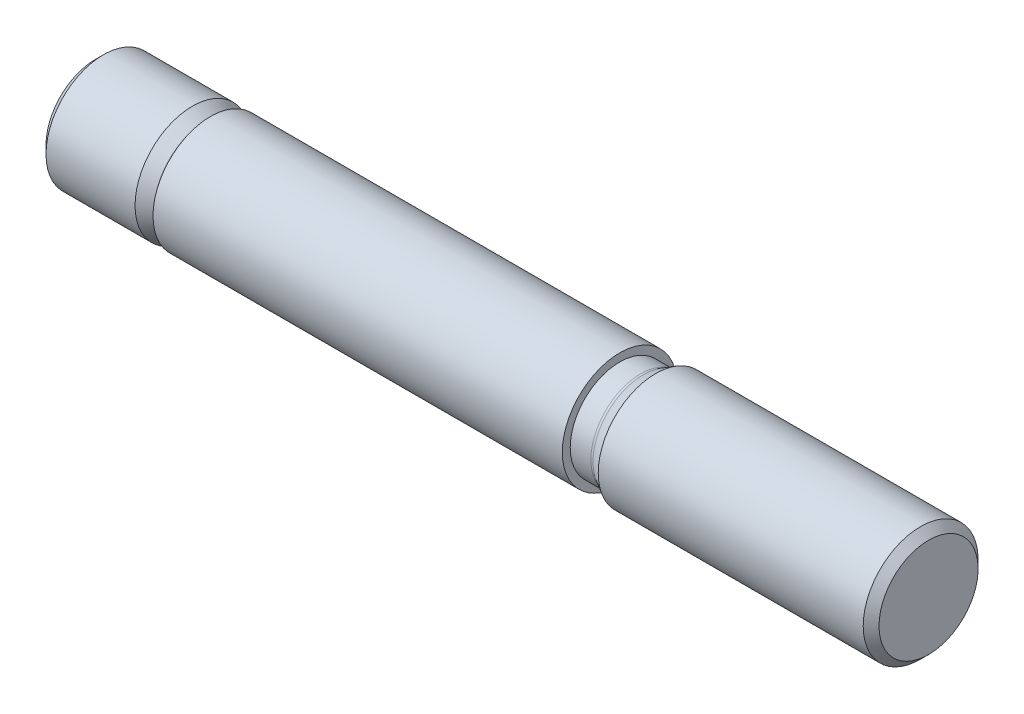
from build123d import *


with BuildPart() as part:
    # BodySke → BaseBody (revolve)
    with BuildSketch(Plane.XY, mode=Mode.PRIVATE) as basebody_sk:
        with BuildLine():
            Line((15.222213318, 7.005679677), (13.5, 8))
            Line((13.5, 8), (1.1015, 8))
            Line((1.1015, 8), (0, 6.8985))
            Line((0, 6.8985), (0, 0))
            Line((0, 0), (116, 0))
            Line((116, 0), (116, 6.8985))
            Line((116, 6.8985), (114.8985, 8))
            Line((114.8985, 8), (78, 8))
            Line((78, 8), (76.277786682, 7.005679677))
            ThreePointArc((76.277786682, 7.005679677), (76.084841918, 6.925759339), (75.877786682, 6.8985))
            Line((75.877786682, 6.8985), (73, 6.8985))
            Line((73, 6.8985), (73, 8))
            Line((73, 8), (16, 8))
            Line((16, 8), (16, 6.8985))
            Line((16, 6.8985), (15.622213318, 6.8985))
            ThreePointArc((15.622213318, 6.8985), (15.415158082, 6.925759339), (15.222213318, 7.005679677))
        make_face()
    revolve(basebody_sk.sketch.rotate(Axis((-14.657708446, 0, 0), (1, 0, 0)), 90), axis=Axis((-14.657708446, 0, 0), (1, 0, 0)))


solid = part.part
